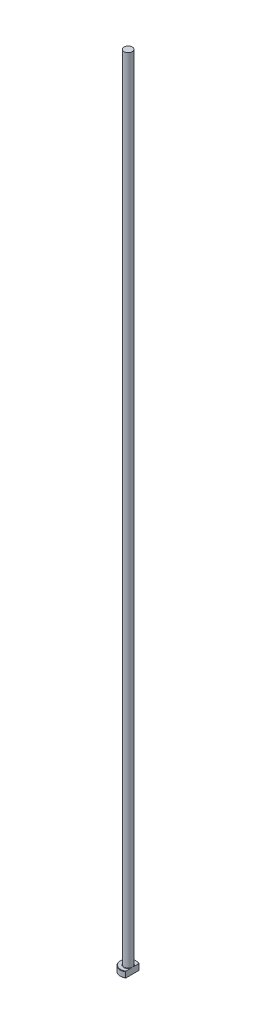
ISO-10303-21;
HEADER;
FILE_DESCRIPTION(('STEP AP214'),'2;1');
FILE_NAME('part.step','',(''),(''),'','','');
FILE_SCHEMA(('AUTOMOTIVE_DESIGN { 1 0 10303 214 1 1 1 1 }'));
ENDSEC;
DATA;
#1=APPLICATION_CONTEXT('core data for automotive mechanical design processes');
#2=APPLICATION_PROTOCOL_DEFINITION('international standard','automotive_design',2000,#1);
#3=PRODUCT_CONTEXT('',#1,'mechanical');
#4=PRODUCT('Part','Part','',(#3));
#5=PRODUCT_RELATED_PRODUCT_CATEGORY('part','',(#4));
#6=PRODUCT_DEFINITION_FORMATION('','',#4);
#7=PRODUCT_DEFINITION_CONTEXT('part definition',#1,'design');
#8=PRODUCT_DEFINITION('design','',#6,#7);
#9=PRODUCT_DEFINITION_SHAPE('','',#8);
#10=(LENGTH_UNIT() NAMED_UNIT(*) SI_UNIT(.MILLI.,.METRE.));
#11=(NAMED_UNIT(*) PLANE_ANGLE_UNIT() SI_UNIT($,.RADIAN.));
#12=(NAMED_UNIT(*) SI_UNIT($,.STERADIAN.) SOLID_ANGLE_UNIT());
#13=UNCERTAINTY_MEASURE_WITH_UNIT(LENGTH_MEASURE(1.E-05),#10,'distance_accuracy_value','');
#14=(GEOMETRIC_REPRESENTATION_CONTEXT(3) GLOBAL_UNCERTAINTY_ASSIGNED_CONTEXT((#13)) GLOBAL_UNIT_ASSIGNED_CONTEXT((#10,
#11,#12)) REPRESENTATION_CONTEXT('',''));
#15=CARTESIAN_POINT('',(0.,0.,0.));
#16=DIRECTION('',(0.,0.,1.));
#17=DIRECTION('',(1.,0.,0.));
#18=AXIS2_PLACEMENT_3D('',#15,#16,#17);
#19=CARTESIAN_POINT('',(0.,0.,0.));
#20=DIRECTION('',(0.,-1.,0.));
#21=DIRECTION('',(0.,0.,-1.));
#22=AXIS2_PLACEMENT_3D('',#19,#20,#21);
#23=PLANE('',#22);
#24=CARTESIAN_POINT('',(0.,0.,0.));
#25=DIRECTION('',(0.,-1.,0.));
#26=DIRECTION('',(0.,0.,-1.));
#27=AXIS2_PLACEMENT_3D('',#24,#25,#26);
#28=CIRCLE('',#27,3.80000000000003);
#29=CARTESIAN_POINT('',(2.04999999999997,0.,3.19960935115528));
#30=VERTEX_POINT('',#29);
#31=CARTESIAN_POINT('',(2.04999999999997,0.,-3.19960935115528));
#32=VERTEX_POINT('',#31);
#33=EDGE_CURVE('E98',#30,#32,#28,.T.);
#34=ORIENTED_EDGE('',*,*,#33,.T.);
#35=DIRECTION('',(0.,0.,1.));
#36=VECTOR('',#35,1.);
#37=CARTESIAN_POINT('',(2.04999999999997,0.,-3.4347488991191));
#38=LINE('',#37,#36);
#39=EDGE_CURVE('E83',#32,#30,#38,.T.);
#40=ORIENTED_EDGE('',*,*,#39,.T.);
#41=EDGE_LOOP('',(#34,#40));
#42=FACE_BOUND('',#41,.T.);
#43=ADVANCED_FACE('F32',(#42),#23,.T.);
#44=CARTESIAN_POINT('',(0.,259.958771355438,0.));
#45=DIRECTION('',(0.,1.,0.));
#46=DIRECTION('',(0.,0.,1.));
#47=AXIS2_PLACEMENT_3D('',#44,#45,#46);
#48=CYLINDRICAL_SURFACE('',#47,3.99999999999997);
#49=CARTESIAN_POINT('',(0.,2.80000000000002,0.));
#50=DIRECTION('',(0.,1.,0.));
#51=DIRECTION('',(0.,0.,1.));
#52=AXIS2_PLACEMENT_3D('',#49,#50,#51);
#53=CIRCLE('',#52,3.99999999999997);
#54=CARTESIAN_POINT('',(2.04999999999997,2.80000000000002,3.4347488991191));
#55=VERTEX_POINT('',#54);
#56=CARTESIAN_POINT('',(2.04999999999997,2.80000000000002,-3.4347488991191));
#57=VERTEX_POINT('',#56);
#58=EDGE_CURVE('E104',#55,#57,#53,.F.);
#59=ORIENTED_EDGE('',*,*,#58,.T.);
#60=DIRECTION('',(0.,-1.,0.));
#61=VECTOR('',#60,1.);
#62=CARTESIAN_POINT('',(2.04999999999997,400.,-3.4347488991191));
#63=LINE('',#62,#61);
#64=CARTESIAN_POINT('',(2.04999999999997,0.199999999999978,-3.4347488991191));
#65=VERTEX_POINT('',#64);
#66=EDGE_CURVE('E183',#57,#65,#63,.T.);
#67=ORIENTED_EDGE('',*,*,#66,.T.);
#68=CARTESIAN_POINT('',(0.,0.199999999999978,0.));
#69=DIRECTION('',(0.,-1.,0.));
#70=DIRECTION('',(0.,0.,-1.));
#71=AXIS2_PLACEMENT_3D('',#68,#69,#70);
#72=CIRCLE('',#71,3.99999999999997);
#73=CARTESIAN_POINT('',(2.04999999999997,0.199999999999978,3.4347488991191));
#74=VERTEX_POINT('',#73);
#75=EDGE_CURVE('E100',#65,#74,#72,.F.);
#76=ORIENTED_EDGE('',*,*,#75,.T.);
#77=DIRECTION('',(0.,-1.,0.));
#78=VECTOR('',#77,1.);
#79=CARTESIAN_POINT('',(2.04999999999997,400.,3.4347488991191));
#80=LINE('',#79,#78);
#81=EDGE_CURVE('E93',#55,#74,#80,.T.);
#82=ORIENTED_EDGE('',*,*,#81,.F.);
#83=EDGE_LOOP('',(#59,#67,#76,#82));
#84=FACE_BOUND('',#83,.T.);
#85=ADVANCED_FACE('F158',(#84),#48,.T.);
#86=CARTESIAN_POINT('',(-3.99999999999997,3.,0.));
#87=DIRECTION('',(0.,1.,0.));
#88=DIRECTION('',(0.,0.,1.));
#89=AXIS2_PLACEMENT_3D('',#86,#87,#88);
#90=PLANE('',#89);
#91=CARTESIAN_POINT('',(0.,3.,0.));
#92=DIRECTION('',(0.,1.,0.));
#93=DIRECTION('',(0.,0.,1.));
#94=AXIS2_PLACEMENT_3D('',#91,#92,#93);
#95=CIRCLE('',#94,3.80000000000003);
#96=CARTESIAN_POINT('',(2.04999999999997,3.,-3.19960935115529));
#97=VERTEX_POINT('',#96);
#98=CARTESIAN_POINT('',(2.04999999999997,3.,3.19960935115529));
#99=VERTEX_POINT('',#98);
#100=EDGE_CURVE('E178',#97,#99,#95,.T.);
#101=ORIENTED_EDGE('',*,*,#100,.T.);
#102=DIRECTION('',(0.,0.,-1.));
#103=VECTOR('',#102,1.);
#104=CARTESIAN_POINT('',(2.04999999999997,3.,0.));
#105=LINE('',#104,#103);
#106=CARTESIAN_POINT('',(2.04999999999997,2.99999999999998,0.927361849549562));
#107=VERTEX_POINT('',#106);
#108=EDGE_CURVE('E57',#99,#107,#105,.T.);
#109=ORIENTED_EDGE('',*,*,#108,.T.);
#110=CARTESIAN_POINT('',(0.,3.,0.));
#111=DIRECTION('',(0.,1.,0.));
#112=DIRECTION('',(0.,0.,1.));
#113=AXIS2_PLACEMENT_3D('',#110,#111,#112);
#114=CIRCLE('',#113,2.24999999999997);
#115=CARTESIAN_POINT('',(2.04999999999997,2.99999999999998,-0.927361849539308));
#116=VERTEX_POINT('',#115);
#117=EDGE_CURVE('E107',#107,#116,#114,.F.);
#118=ORIENTED_EDGE('',*,*,#117,.T.);
#119=EDGE_CURVE('E136',#116,#97,#105,.T.);
#120=ORIENTED_EDGE('',*,*,#119,.T.);
#121=EDGE_LOOP('',(#101,#109,#118,#120));
#122=FACE_BOUND('',#121,.T.);
#123=ADVANCED_FACE('F147',(#122),#90,.T.);
#124=CARTESIAN_POINT('',(0.,3.,0.));
#125=DIRECTION('',(0.,-1.,0.));
#126=DIRECTION('',(0.,0.,-1.));
#127=AXIS2_PLACEMENT_3D('',#124,#125,#126);
#128=CONICAL_SURFACE('',#127,3.80000000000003,0.785398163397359);
#129=ORIENTED_EDGE('',*,*,#58,.F.);
#130=CARTESIAN_POINT('',(2.04999999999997,-1.03146351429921,7.55839406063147));
#131=CARTESIAN_POINT('',(2.04999999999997,-0.873904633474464,7.39513453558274));
#132=CARTESIAN_POINT('',(2.04999999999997,-0.716518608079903,7.23170767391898));
#133=CARTESIAN_POINT('',(2.04999999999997,-0.402187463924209,6.90442717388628));
#134=CARTESIAN_POINT('',(2.04999999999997,-0.245242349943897,6.74057353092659));
#135=CARTESIAN_POINT('',(2.04999999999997,0.0681734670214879,6.41228269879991));
#136=CARTESIAN_POINT('',(2.04999999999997,0.224643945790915,6.2478452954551));
#137=CARTESIAN_POINT('',(2.04999999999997,0.536906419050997,5.91832867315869));
#138=CARTESIAN_POINT('',(2.04999999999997,0.692698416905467,5.75324945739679));
#139=CARTESIAN_POINT('',(2.04999999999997,1.00064251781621,5.42523572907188));
#140=CARTESIAN_POINT('',(2.04999999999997,1.15280992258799,5.26231559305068));
#141=CARTESIAN_POINT('',(2.04999999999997,1.4560630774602,4.93547204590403));
#142=CARTESIAN_POINT('',(2.04999999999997,1.60714883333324,4.77154864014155));
#143=CARTESIAN_POINT('',(2.04999999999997,1.9078557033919,4.44241540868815));
#144=CARTESIAN_POINT('',(2.04999999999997,2.0574770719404,4.27720581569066));
#145=CARTESIAN_POINT('',(2.04999999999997,2.35475209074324,3.94502824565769));
#146=CARTESIAN_POINT('',(2.04999999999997,2.50240579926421,3.77806032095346));
#147=CARTESIAN_POINT('',(2.04999999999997,2.74781587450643,3.49583336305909));
#148=CARTESIAN_POINT('',(2.04999999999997,2.84633082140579,3.38123477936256));
#149=CARTESIAN_POINT('',(2.04999999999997,3.04168132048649,3.15059166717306));
#150=CARTESIAN_POINT('',(2.04999999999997,3.13851670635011,3.0345469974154));
#151=CARTESIAN_POINT('',(2.04999999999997,3.33089134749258,2.79943466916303));
#152=CARTESIAN_POINT('',(2.04999999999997,3.42640790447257,2.68034837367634));
#153=CARTESIAN_POINT('',(2.04999999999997,3.61424509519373,2.43971344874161));
#154=CARTESIAN_POINT('',(2.04999999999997,3.70656652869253,2.31816544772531));
#155=CARTESIAN_POINT('',(2.04999999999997,3.88795970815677,2.06996820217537));
#156=CARTESIAN_POINT('',(2.04999999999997,3.97696605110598,1.94327085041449));
#157=CARTESIAN_POINT('',(2.04999999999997,4.14815278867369,1.68499648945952));
#158=CARTESIAN_POINT('',(2.04999999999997,4.23032373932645,1.55341308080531));
#159=CARTESIAN_POINT('',(2.04999999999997,4.34487781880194,1.3520675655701));
#160=CARTESIAN_POINT('',(2.04999999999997,4.38142455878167,1.28469323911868));
#161=CARTESIAN_POINT('',(2.04999999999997,4.45108462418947,1.14819983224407));
#162=CARTESIAN_POINT('',(2.04999999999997,4.48419730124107,1.07908042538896));
#163=CARTESIAN_POINT('',(2.04999999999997,4.57688716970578,0.869158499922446));
#164=CARTESIAN_POINT('',(2.04999999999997,4.6301133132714,0.725295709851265));
#165=CARTESIAN_POINT('',(2.04999999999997,4.6885814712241,0.50978217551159));
#166=CARTESIAN_POINT('',(2.04999999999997,4.70423178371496,0.440932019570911));
#167=CARTESIAN_POINT('',(2.04999999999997,4.72899377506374,0.30204122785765));
#168=CARTESIAN_POINT('',(2.04999999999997,4.73810615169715,0.232000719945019));
#169=CARTESIAN_POINT('',(2.04999999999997,4.74914212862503,0.0916144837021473));
#170=CARTESIAN_POINT('',(2.04999999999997,4.75109292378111,0.021270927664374));
#171=CARTESIAN_POINT('',(2.04999999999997,4.74773665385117,-0.119244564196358));
#172=CARTESIAN_POINT('',(2.04999999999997,4.74242910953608,-0.189416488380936));
#173=CARTESIAN_POINT('',(2.04999999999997,4.72500657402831,-0.328355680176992));
#174=CARTESIAN_POINT('',(2.04999999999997,4.71294307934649,-0.397129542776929));
#175=CARTESIAN_POINT('',(2.04999999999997,4.68280191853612,-0.533332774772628));
#176=CARTESIAN_POINT('',(2.04999999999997,4.66472343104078,-0.600761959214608));
#177=CARTESIAN_POINT('',(2.04999999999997,4.62334379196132,-0.734440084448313));
#178=CARTESIAN_POINT('',(2.04999999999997,4.60001057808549,-0.800678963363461));
#179=CARTESIAN_POINT('',(2.04999999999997,4.54910792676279,-0.931471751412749));
#180=CARTESIAN_POINT('',(2.04999999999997,4.52153930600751,-0.996025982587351));
#181=CARTESIAN_POINT('',(2.04999999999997,4.43580994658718,-1.18273856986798));
#182=CARTESIAN_POINT('',(2.04999999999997,4.3730026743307,-1.30275656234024));
#183=CARTESIAN_POINT('',(2.04999999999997,4.23899016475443,-1.53805589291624));
#184=CARTESIAN_POINT('',(2.04999999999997,4.16777470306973,-1.6533312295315));
#185=CARTESIAN_POINT('',(2.04999999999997,4.01940383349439,-1.88059522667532));
#186=CARTESIAN_POINT('',(2.04999999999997,3.94222660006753,-1.99256951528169));
#187=CARTESIAN_POINT('',(2.04999999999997,3.78394545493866,-2.21359913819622));
#188=CARTESIAN_POINT('',(2.04999999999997,3.7028434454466,-2.32265584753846));
#189=CARTESIAN_POINT('',(2.04999999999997,3.5367260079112,-2.53996457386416));
#190=CARTESIAN_POINT('',(2.04999999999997,3.45167369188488,-2.64818825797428));
#191=CARTESIAN_POINT('',(2.04999999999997,3.27939927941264,-2.86290587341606));
#192=CARTESIAN_POINT('',(2.04999999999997,3.19217696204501,-2.96939962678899));
#193=CARTESIAN_POINT('',(2.04999999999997,3.01630213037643,-3.18076958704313));
#194=CARTESIAN_POINT('',(2.04999999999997,2.92765349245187,-3.28564902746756));
#195=CARTESIAN_POINT('',(2.04999999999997,2.74908778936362,-3.49432359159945));
#196=CARTESIAN_POINT('',(2.04999999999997,2.65917070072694,-3.59811869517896));
#197=CARTESIAN_POINT('',(2.04999999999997,2.42106477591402,-3.87030922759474));
#198=CARTESIAN_POINT('',(2.04999999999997,2.27204417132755,-4.03797649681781));
#199=CARTESIAN_POINT('',(2.04999999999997,1.97212991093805,-4.37162983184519));
#200=CARTESIAN_POINT('',(2.04999999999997,1.82123620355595,-4.53761585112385));
#201=CARTESIAN_POINT('',(2.04999999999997,1.51793530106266,-4.8684779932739));
#202=CARTESIAN_POINT('',(2.04999999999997,1.36552684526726,-5.03335295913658));
#203=CARTESIAN_POINT('',(2.04999999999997,1.059671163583,-5.36213642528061));
#204=CARTESIAN_POINT('',(2.04999999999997,0.906223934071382,-5.52604492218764));
#205=CARTESIAN_POINT('',(2.04999999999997,0.604770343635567,-5.84646863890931));
#206=CARTESIAN_POINT('',(2.04999999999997,0.456795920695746,-6.00301392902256));
#207=CARTESIAN_POINT('',(2.04999999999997,0.160257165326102,-6.31554566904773));
#208=CARTESIAN_POINT('',(2.04999999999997,0.0116928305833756,-6.47153211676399));
#209=CARTESIAN_POINT('',(2.04999999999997,-0.285748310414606,-6.78287905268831));
#210=CARTESIAN_POINT('',(2.04999999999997,-0.434624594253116,-6.93824004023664));
#211=CARTESIAN_POINT('',(2.04999999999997,-0.73276964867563,-7.24858246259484));
#212=CARTESIAN_POINT('',(2.04999999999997,-0.882038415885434,-7.40356390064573));
#213=CARTESIAN_POINT('',(2.04999999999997,-1.03146351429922,-7.55839406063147));
#214=B_SPLINE_CURVE_WITH_KNOTS('',3,(#130,#131,#132,#133,#134,#135,#136,#137,#138,#139,#140,
#141,#142,#143,#144,#145,#146,#147,#148,#149,#150,#151,#152,#153,#154,#155,#156,#157,#158,#159,
#160,#161,#162,#163,#164,#165,#166,#167,#168,#169,#170,#171,#172,#173,#174,#175,#176,#177,#178,
#179,#180,#181,#182,#183,#184,#185,#186,#187,#188,#189,#190,#191,#192,#193,#194,#195,#196,#197,
#198,#199,#200,#201,#202,#203,#204,#205,#206,#207,#208,#209,#210,#211,#212,#213),.UNSPECIFIED.,
.F.,.F.,(4,2,2,2,2,2,2,2,2,2,2,2,2,2,2,2,2,2,2,2,2,2,2,2,2,2,2,2,2,2,2,2,2,2,2,2,2,2,2,2,2,4),
(0.,0.680666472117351,1.36134029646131,2.04229694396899,2.72325021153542,3.39203729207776,
4.06082080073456,4.72948600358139,5.3981313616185,5.85148716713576,6.30488761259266,
6.76282955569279,7.22065603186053,7.68503359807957,8.1500424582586,8.37989203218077,
8.60978492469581,9.06784199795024,9.27940643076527,9.49094828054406,9.70168600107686,
9.91243763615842,10.1216042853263,10.33079950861,10.5413075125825,10.751774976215,
11.1575695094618,11.5638626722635,11.9717209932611,12.3793835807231,12.7922829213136,
13.2052244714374,13.6171880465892,14.0291592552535,14.7020968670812,15.3750530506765,
16.0486261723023,16.722201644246,17.3684394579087,18.0146798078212,18.6602103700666,
19.3057354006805),.UNSPECIFIED.);
#215=EDGE_CURVE('E135',#55,#99,#214,.T.);
#216=ORIENTED_EDGE('',*,*,#215,.T.);
#217=ORIENTED_EDGE('',*,*,#100,.F.);
#218=EDGE_CURVE('E127',#97,#57,#214,.T.);
#219=ORIENTED_EDGE('',*,*,#218,.T.);
#220=EDGE_LOOP('',(#129,#216,#217,#219));
#221=FACE_BOUND('',#220,.T.);
#222=ADVANCED_FACE('F143',(#221),#128,.T.);
#223=CARTESIAN_POINT('',(0.,0.199999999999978,0.));
#224=DIRECTION('',(0.,1.,0.));
#225=DIRECTION('',(0.,0.,1.));
#226=AXIS2_PLACEMENT_3D('',#223,#224,#225);
#227=CONICAL_SURFACE('',#226,3.99999999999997,0.785398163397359);
#228=ORIENTED_EDGE('',*,*,#75,.F.);
#229=CARTESIAN_POINT('',(2.04999999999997,4.03146351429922,-7.55839406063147));
#230=CARTESIAN_POINT('',(2.04999999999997,3.87390463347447,-7.39513453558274));
#231=CARTESIAN_POINT('',(2.04999999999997,3.7165186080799,-7.23170767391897));
#232=CARTESIAN_POINT('',(2.04999999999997,3.40218746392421,-6.90442717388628));
#233=CARTESIAN_POINT('',(2.04999999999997,3.2452423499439,-6.74057353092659));
#234=CARTESIAN_POINT('',(2.04999999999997,2.93182653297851,-6.41228269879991));
#235=CARTESIAN_POINT('',(2.04999999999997,2.77535605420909,-6.2478452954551));
#236=CARTESIAN_POINT('',(2.04999999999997,2.463093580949,-5.91832867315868));
#237=CARTESIAN_POINT('',(2.04999999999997,2.30730158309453,-5.75324945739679));
#238=CARTESIAN_POINT('',(2.04999999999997,1.99935748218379,-5.42523572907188));
#239=CARTESIAN_POINT('',(2.04999999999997,1.84719007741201,-5.26231559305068));
#240=CARTESIAN_POINT('',(2.04999999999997,1.5439369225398,-4.93547204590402));
#241=CARTESIAN_POINT('',(2.04999999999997,1.39285116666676,-4.77154864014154));
#242=CARTESIAN_POINT('',(2.04999999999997,1.0921442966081,-4.44241540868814));
#243=CARTESIAN_POINT('',(2.04999999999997,0.942522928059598,-4.27720581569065));
#244=CARTESIAN_POINT('',(2.04999999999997,0.645247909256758,-3.94502824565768));
#245=CARTESIAN_POINT('',(2.04999999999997,0.497594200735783,-3.77806032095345));
#246=CARTESIAN_POINT('',(2.04999999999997,0.25218412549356,-3.49583336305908));
#247=CARTESIAN_POINT('',(2.04999999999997,0.153669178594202,-3.38123477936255));
#248=CARTESIAN_POINT('',(2.04999999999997,-0.0416813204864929,-3.15059166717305));
#249=CARTESIAN_POINT('',(2.04999999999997,-0.138516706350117,-3.03454699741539));
#250=CARTESIAN_POINT('',(2.04999999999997,-0.330891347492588,-2.79943466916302));
#251=CARTESIAN_POINT('',(2.04999999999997,-0.426407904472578,-2.68034837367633));
#252=CARTESIAN_POINT('',(2.04999999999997,-0.614245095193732,-2.43971344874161));
#253=CARTESIAN_POINT('',(2.04999999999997,-0.70656652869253,-2.3181654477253));
#254=CARTESIAN_POINT('',(2.04999999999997,-0.887959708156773,-2.06996820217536));
#255=CARTESIAN_POINT('',(2.04999999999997,-0.976966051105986,-1.94327085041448));
#256=CARTESIAN_POINT('',(2.04999999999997,-1.14815278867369,-1.68499648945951));
#257=CARTESIAN_POINT('',(2.04999999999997,-1.23032373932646,-1.5534130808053));
#258=CARTESIAN_POINT('',(2.04999999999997,-1.34487781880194,-1.35206756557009));
#259=CARTESIAN_POINT('',(2.04999999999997,-1.38142455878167,-1.28469323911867));
#260=CARTESIAN_POINT('',(2.04999999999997,-1.45108462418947,-1.14819983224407));
#261=CARTESIAN_POINT('',(2.04999999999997,-1.48419730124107,-1.07908042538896));
#262=CARTESIAN_POINT('',(2.04999999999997,-1.57688716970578,-0.86915849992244));
#263=CARTESIAN_POINT('',(2.04999999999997,-1.63011331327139,-0.72529570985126));
#264=CARTESIAN_POINT('',(2.04999999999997,-1.6885814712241,-0.509782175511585));
#265=CARTESIAN_POINT('',(2.04999999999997,-1.70423178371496,-0.440932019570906));
#266=CARTESIAN_POINT('',(2.04999999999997,-1.72899377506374,-0.302041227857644));
#267=CARTESIAN_POINT('',(2.04999999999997,-1.73810615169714,-0.232000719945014));
#268=CARTESIAN_POINT('',(2.04999999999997,-1.74914212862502,-0.0916144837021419));
#269=CARTESIAN_POINT('',(2.04999999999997,-1.75109292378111,-0.0212709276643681));
#270=CARTESIAN_POINT('',(2.04999999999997,-1.74773665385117,0.119244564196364));
#271=CARTESIAN_POINT('',(2.04999999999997,-1.74242910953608,0.189416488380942));
#272=CARTESIAN_POINT('',(2.04999999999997,-1.72500657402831,0.328355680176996));
#273=CARTESIAN_POINT('',(2.04999999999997,-1.71294307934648,0.397129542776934));
#274=CARTESIAN_POINT('',(2.04999999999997,-1.68280191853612,0.533332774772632));
#275=CARTESIAN_POINT('',(2.04999999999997,-1.66472343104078,0.600761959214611));
#276=CARTESIAN_POINT('',(2.04999999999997,-1.62334379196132,0.734440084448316));
#277=CARTESIAN_POINT('',(2.04999999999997,-1.60001057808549,0.800678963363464));
#278=CARTESIAN_POINT('',(2.04999999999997,-1.54910792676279,0.931471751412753));
#279=CARTESIAN_POINT('',(2.04999999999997,-1.5215393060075,0.996025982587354));
#280=CARTESIAN_POINT('',(2.04999999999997,-1.43580994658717,1.18273856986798));
#281=CARTESIAN_POINT('',(2.04999999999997,-1.37300267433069,1.30275656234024));
#282=CARTESIAN_POINT('',(2.04999999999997,-1.23899016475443,1.53805589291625));
#283=CARTESIAN_POINT('',(2.04999999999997,-1.16777470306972,1.65333122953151));
#284=CARTESIAN_POINT('',(2.04999999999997,-1.01940383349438,1.88059522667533));
#285=CARTESIAN_POINT('',(2.04999999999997,-0.942226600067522,1.9925695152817));
#286=CARTESIAN_POINT('',(2.04999999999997,-0.783945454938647,2.21359913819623));
#287=CARTESIAN_POINT('',(2.04999999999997,-0.702843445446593,2.32265584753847));
#288=CARTESIAN_POINT('',(2.04999999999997,-0.536726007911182,2.53996457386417));
#289=CARTESIAN_POINT('',(2.04999999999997,-0.451673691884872,2.6481882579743));
#290=CARTESIAN_POINT('',(2.04999999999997,-0.279399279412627,2.86290587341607));
#291=CARTESIAN_POINT('',(2.04999999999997,-0.192176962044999,2.96939962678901));
#292=CARTESIAN_POINT('',(2.04999999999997,-0.0163021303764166,3.18076958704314));
#293=CARTESIAN_POINT('',(2.04999999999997,0.0723465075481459,3.28564902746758));
#294=CARTESIAN_POINT('',(2.04999999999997,0.250912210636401,3.49432359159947));
#295=CARTESIAN_POINT('',(2.04999999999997,0.340829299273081,3.59811869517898));
#296=CARTESIAN_POINT('',(2.04999999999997,0.578935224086,3.87030922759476));
#297=CARTESIAN_POINT('',(2.04999999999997,0.727955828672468,4.03797649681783));
#298=CARTESIAN_POINT('',(2.04999999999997,1.02787008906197,4.3716298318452));
#299=CARTESIAN_POINT('',(2.04999999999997,1.17876379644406,4.53761585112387));
#300=CARTESIAN_POINT('',(2.04999999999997,1.48206469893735,4.86847799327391));
#301=CARTESIAN_POINT('',(2.04999999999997,1.63447315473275,5.03335295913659));
#302=CARTESIAN_POINT('',(2.04999999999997,1.94032883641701,5.36213642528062));
#303=CARTESIAN_POINT('',(2.04999999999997,2.09377606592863,5.52604492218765));
#304=CARTESIAN_POINT('',(2.04999999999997,2.39522965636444,5.84646863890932));
#305=CARTESIAN_POINT('',(2.04999999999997,2.54320407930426,6.00301392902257));
#306=CARTESIAN_POINT('',(2.04999999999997,2.83974283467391,6.31554566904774));
#307=CARTESIAN_POINT('',(2.04999999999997,2.98830716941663,6.47153211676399));
#308=CARTESIAN_POINT('',(2.04999999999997,3.28574831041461,6.78287905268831));
#309=CARTESIAN_POINT('',(2.04999999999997,3.43462459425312,6.93824004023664));
#310=CARTESIAN_POINT('',(2.04999999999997,3.73276964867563,7.24858246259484));
#311=CARTESIAN_POINT('',(2.04999999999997,3.88203841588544,7.40356390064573));
#312=CARTESIAN_POINT('',(2.04999999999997,4.03146351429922,7.55839406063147));
#313=B_SPLINE_CURVE_WITH_KNOTS('',3,(#229,#230,#231,#232,#233,#234,#235,#236,#237,#238,#239,
#240,#241,#242,#243,#244,#245,#246,#247,#248,#249,#250,#251,#252,#253,#254,#255,#256,#257,#258,
#259,#260,#261,#262,#263,#264,#265,#266,#267,#268,#269,#270,#271,#272,#273,#274,#275,#276,#277,
#278,#279,#280,#281,#282,#283,#284,#285,#286,#287,#288,#289,#290,#291,#292,#293,#294,#295,#296,
#297,#298,#299,#300,#301,#302,#303,#304,#305,#306,#307,#308,#309,#310,#311,#312),.UNSPECIFIED.,
.F.,.F.,(4,2,2,2,2,2,2,2,2,2,2,2,2,2,2,2,2,2,2,2,2,2,2,2,2,2,2,2,2,2,2,2,2,2,2,2,2,2,2,2,2,4),
(0.,0.680666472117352,1.36134029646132,2.042296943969,2.72325021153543,3.39203729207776,
4.06082080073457,4.72948600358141,5.39813136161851,5.85148716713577,6.30488761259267,
6.7628295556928,7.22065603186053,7.68503359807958,8.15004245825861,8.37989203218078,
8.60978492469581,9.06784199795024,9.27940643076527,9.49094828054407,9.70168600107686,
9.91243763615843,10.1216042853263,10.33079950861,10.5413075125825,10.751774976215,
11.1575695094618,11.5638626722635,11.9717209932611,12.3793835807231,12.7922829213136,
13.2052244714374,13.6171880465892,14.0291592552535,14.7020968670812,15.3750530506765,
16.0486261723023,16.722201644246,17.3684394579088,18.0146798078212,18.6602103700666,
19.3057354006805),.UNSPECIFIED.);
#314=EDGE_CURVE('E86',#65,#32,#313,.T.);
#315=ORIENTED_EDGE('',*,*,#314,.T.);
#316=ORIENTED_EDGE('',*,*,#33,.F.);
#317=EDGE_CURVE('E89',#30,#74,#313,.T.);
#318=ORIENTED_EDGE('',*,*,#317,.T.);
#319=EDGE_LOOP('',(#228,#315,#316,#318));
#320=FACE_BOUND('',#319,.T.);
#321=ADVANCED_FACE('F97',(#320),#227,.T.);
#322=CARTESIAN_POINT('',(0.,3.19999999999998,0.));
#323=DIRECTION('',(0.,1.,0.));
#324=DIRECTION('',(0.,0.,1.));
#325=AXIS2_PLACEMENT_3D('',#322,#323,#324);
#326=TOROIDAL_SURFACE('',#325,2.24999999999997,0.2);
#327=CARTESIAN_POINT('',(2.04999999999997,3.19999999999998,0.));
#328=CARTESIAN_POINT('',(2.04999999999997,3.20000050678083,1.11433978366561E-10));
#329=CARTESIAN_POINT('',(2.04999999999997,3.20000101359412,-1.49199173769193E-07));
#330=CARTESIAN_POINT('',(2.04999999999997,3.20000197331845,-5.90092849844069E-07));
#331=CARTESIAN_POINT('',(2.04999999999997,3.20000242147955,-8.89334890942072E-07));
#332=CARTESIAN_POINT('',(2.04999999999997,3.200003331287,-1.60386249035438E-06));
#333=CARTESIAN_POINT('',(2.04999999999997,3.20000378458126,-2.02988262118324E-06));
#334=CARTESIAN_POINT('',(2.04999999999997,3.20000461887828,-2.92958555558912E-06));
#335=CARTESIAN_POINT('',(2.04999999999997,3.20000500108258,-3.40221864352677E-06));
#336=CARTESIAN_POINT('',(2.04999999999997,3.20000635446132,-5.1677876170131E-06));
#337=CARTESIAN_POINT('',(2.04999999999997,3.20000725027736,-6.52020726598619E-06));
#338=CARTESIAN_POINT('',(2.04999999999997,3.20000878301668,-9.25136186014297E-06));
#339=CARTESIAN_POINT('',(2.04999999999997,3.20000943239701,-1.06234618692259E-05));
#340=CARTESIAN_POINT('',(2.04999999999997,3.20001203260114,-1.6232674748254E-05));
#341=CARTESIAN_POINT('',(2.04999999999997,3.20001389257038,-2.05163580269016E-05));
#342=CARTESIAN_POINT('',(2.04999999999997,3.20001674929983,-2.87532844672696E-05));
#343=CARTESIAN_POINT('',(2.04999999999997,3.20001782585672,-3.2679073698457E-05));
#344=CARTESIAN_POINT('',(2.04999999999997,3.20002546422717,-6.12436551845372E-05));
#345=CARTESIAN_POINT('',(2.04999999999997,3.20003105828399,-8.60941961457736E-05));
#346=CARTESIAN_POINT('',(2.04999999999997,3.20005552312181,-0.000183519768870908));
#347=CARTESIAN_POINT('',(2.04999999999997,3.20007904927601,-0.000254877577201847));
#348=CARTESIAN_POINT('',(2.04999999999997,3.20016988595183,-0.000535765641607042));
#349=CARTESIAN_POINT('',(2.04999999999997,3.20023402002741,-0.000746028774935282));
#350=CARTESIAN_POINT('',(2.04999999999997,3.20048927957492,-0.0015758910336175));
#351=CARTESIAN_POINT('',(2.04999999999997,3.20068429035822,-0.00219457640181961));
#352=CARTESIAN_POINT('',(2.04999999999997,3.20148922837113,-0.00475596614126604));
#353=CARTESIAN_POINT('',(2.04999999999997,3.20209434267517,-0.0066998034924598));
#354=CARTESIAN_POINT('',(2.04999999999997,3.20817248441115,-0.026215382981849));
#355=CARTESIAN_POINT('',(2.04999999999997,3.21366777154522,-0.0437820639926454));
#356=CARTESIAN_POINT('',(2.04999999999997,3.22440004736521,-0.0782469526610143));
#357=CARTESIAN_POINT('',(2.04999999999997,3.22963878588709,-0.0951446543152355));
#358=CARTESIAN_POINT('',(2.04999999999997,3.24070596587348,-0.13103721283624));
#359=CARTESIAN_POINT('',(2.04999999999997,3.24652762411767,-0.150034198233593));
#360=CARTESIAN_POINT('',(2.04999999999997,3.25812563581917,-0.188263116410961));
#361=CARTESIAN_POINT('',(2.04999999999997,3.26390084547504,-0.207495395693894));
#362=CARTESIAN_POINT('',(2.04999999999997,3.27784177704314,-0.254568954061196));
#363=CARTESIAN_POINT('',(2.04999999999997,3.28592802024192,-0.282433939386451));
#364=CARTESIAN_POINT('',(2.04999999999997,3.30147824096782,-0.337598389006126));
#365=CARTESIAN_POINT('',(2.04999999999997,3.30895263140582,-0.364894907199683));
#366=CARTESIAN_POINT('',(2.04999999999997,3.32487272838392,-0.425333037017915));
#367=CARTESIAN_POINT('',(2.04999999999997,3.33319621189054,-0.458507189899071));
#368=CARTESIAN_POINT('',(2.04999999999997,3.34887938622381,-0.525344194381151));
#369=CARTESIAN_POINT('',(2.04999999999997,3.35623148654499,-0.559008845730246));
#370=CARTESIAN_POINT('',(2.04999999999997,3.3700913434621,-0.629073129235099));
#371=CARTESIAN_POINT('',(2.04999999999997,3.37649834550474,-0.665493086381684));
#372=CARTESIAN_POINT('',(2.04999999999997,3.38732437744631,-0.738624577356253));
#373=CARTESIAN_POINT('',(2.04999999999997,3.39174404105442,-0.775336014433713));
#374=CARTESIAN_POINT('',(2.04999999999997,3.39842323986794,-0.853869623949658));
#375=CARTESIAN_POINT('',(2.04999999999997,3.40031921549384,-0.895724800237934));
#376=CARTESIAN_POINT('',(2.04999999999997,3.3995967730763,-0.978802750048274));
#377=CARTESIAN_POINT('',(2.04999999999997,3.39705088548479,-1.02002480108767));
#378=CARTESIAN_POINT('',(2.04999999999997,3.38815866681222,-1.08355885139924));
#379=CARTESIAN_POINT('',(2.04999999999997,3.38399133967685,-1.10617047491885));
#380=CARTESIAN_POINT('',(2.04999999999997,3.37312056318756,-1.1508734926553));
#381=CARTESIAN_POINT('',(2.04999999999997,3.36641150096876,-1.17296361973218));
#382=CARTESIAN_POINT('',(2.04999999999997,3.35241630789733,-1.20879754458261));
#383=CARTESIAN_POINT('',(2.04999999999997,3.34604663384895,-1.22289572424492));
#384=CARTESIAN_POINT('',(2.04999999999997,3.33145856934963,-1.25010305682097));
#385=CARTESIAN_POINT('',(2.04999999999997,3.32324484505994,-1.26321459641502));
#386=CARTESIAN_POINT('',(2.04999999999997,3.30807074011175,-1.28311183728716));
#387=CARTESIAN_POINT('',(2.04999999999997,3.30180162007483,-1.29042146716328));
#388=CARTESIAN_POINT('',(2.04999999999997,3.28827985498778,-1.30407693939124));
#389=CARTESIAN_POINT('',(2.04999999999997,3.28102850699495,-1.31042402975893));
#390=CARTESIAN_POINT('',(2.04999999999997,3.26730073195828,-1.32042781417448));
#391=CARTESIAN_POINT('',(2.04999999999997,3.26103227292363,-1.32436729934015));
#392=CARTESIAN_POINT('',(2.04999999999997,3.24793774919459,-1.33118589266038));
#393=CARTESIAN_POINT('',(2.04999999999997,3.2411121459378,-1.3340658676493));
#394=CARTESIAN_POINT('',(2.04999999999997,3.22696550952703,-1.33854399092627));
#395=CARTESIAN_POINT('',(2.04999999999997,3.21964010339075,-1.34012865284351));
#396=CARTESIAN_POINT('',(2.04999999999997,3.20482104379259,-1.34178557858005));
#397=CARTESIAN_POINT('',(2.04999999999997,3.19732755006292,-1.34185922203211));
#398=CARTESIAN_POINT('',(2.04999999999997,3.18362821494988,-1.34059674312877));
#399=CARTESIAN_POINT('',(2.04999999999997,3.17740126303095,-1.3394752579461));
#400=CARTESIAN_POINT('',(2.04999999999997,3.16521180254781,-1.33624238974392));
#401=CARTESIAN_POINT('',(2.04999999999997,3.15924940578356,-1.33413059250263));
#402=CARTESIAN_POINT('',(2.04999999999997,3.14588128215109,-1.32826056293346));
#403=CARTESIAN_POINT('',(2.04999999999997,3.13861186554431,-1.324193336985));
#404=CARTESIAN_POINT('',(2.04999999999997,3.1248230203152,-1.314942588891));
#405=CARTESIAN_POINT('',(2.04999999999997,3.11830521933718,-1.30975671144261));
#406=CARTESIAN_POINT('',(2.04999999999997,3.10285879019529,-1.29569016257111));
#407=CARTESIAN_POINT('',(2.04999999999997,3.09441467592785,-1.28628110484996));
#408=CARTESIAN_POINT('',(2.04999999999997,3.07905572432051,-1.26631405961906));
#409=CARTESIAN_POINT('',(2.04999999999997,3.07214294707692,-1.25575455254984));
#410=CARTESIAN_POINT('',(2.04999999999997,3.05475343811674,-1.22547453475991));
#411=CARTESIAN_POINT('',(2.04999999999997,3.04564540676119,-1.20497519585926));
#412=CARTESIAN_POINT('',(2.04999999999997,3.03036658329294,-1.16279344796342));
#413=CARTESIAN_POINT('',(2.04999999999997,3.02422151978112,-1.14110243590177));
#414=CARTESIAN_POINT('',(2.04999999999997,3.01411308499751,-1.09654657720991));
#415=CARTESIAN_POINT('',(2.04999999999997,3.01022074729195,-1.07366604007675));
#416=CARTESIAN_POINT('',(2.04999999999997,3.00438595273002,-1.02762855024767));
#417=CARTESIAN_POINT('',(2.04999999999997,3.00244735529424,-1.00447114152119));
#418=CARTESIAN_POINT('',(2.04999999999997,2.99907945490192,-0.936481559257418));
#419=CARTESIAN_POINT('',(2.04999999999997,2.99980550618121,-0.891546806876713));
#420=CARTESIAN_POINT('',(2.04999999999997,3.00639312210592,-0.785106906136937));
#421=CARTESIAN_POINT('',(2.04999999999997,3.01408723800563,-0.723739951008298));
#422=CARTESIAN_POINT('',(2.04999999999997,3.03471721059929,-0.600423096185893));
#423=CARTESIAN_POINT('',(2.04999999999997,3.04777621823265,-0.538495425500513));
#424=CARTESIAN_POINT('',(2.04999999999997,3.07250330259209,-0.435218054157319));
#425=CARTESIAN_POINT('',(2.04999999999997,3.08327201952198,-0.393644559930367));
#426=CARTESIAN_POINT('',(2.04999999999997,3.1057691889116,-0.311244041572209));
#427=CARTESIAN_POINT('',(2.04999999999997,3.117485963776,-0.270413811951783));
#428=CARTESIAN_POINT('',(2.04999999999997,3.14023315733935,-0.193479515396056));
#429=CARTESIAN_POINT('',(2.04999999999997,3.15119500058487,-0.157354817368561));
#430=CARTESIAN_POINT('',(2.04999999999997,3.17387809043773,-0.083701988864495));
#431=CARTESIAN_POINT('',(2.04999999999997,3.18561198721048,-0.0461776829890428));
#432=CARTESIAN_POINT('',(2.04999999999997,3.19790660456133,-0.00669647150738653));
#433=CARTESIAN_POINT('',(2.04999999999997,3.19851281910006,-0.00474933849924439));
#434=CARTESIAN_POINT('',(2.04999999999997,3.19931801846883,-0.00218718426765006));
#435=CARTESIAN_POINT('',(2.04999999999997,3.19951222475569,-0.00157103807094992));
#436=CARTESIAN_POINT('',(2.04999999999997,3.1997665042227,-0.000744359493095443));
#437=CARTESIAN_POINT('',(2.04999999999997,3.1998304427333,-0.000534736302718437));
#438=CARTESIAN_POINT('',(2.04999999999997,3.19992104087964,-0.000254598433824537));
#439=CARTESIAN_POINT('',(2.04999999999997,3.19994453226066,-0.000183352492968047));
#440=CARTESIAN_POINT('',(2.04999999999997,3.19996896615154,-8.60574042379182E-05));
#441=CARTESIAN_POINT('',(2.04999999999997,3.19997455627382,-6.12234779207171E-05));
#442=CARTESIAN_POINT('',(2.04999999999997,3.19998218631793,-3.26756404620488E-05));
#443=CARTESIAN_POINT('',(2.04999999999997,3.19998326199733,-2.87508616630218E-05));
#444=CARTESIAN_POINT('',(2.04999999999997,3.19998611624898,-2.05159271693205E-05));
#445=CARTESIAN_POINT('',(2.04999999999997,3.19998797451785,-1.62331737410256E-05));
#446=CARTESIAN_POINT('',(2.04999999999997,3.19999057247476,-1.06248953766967E-05));
#447=CARTESIAN_POINT('',(2.04999999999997,3.19999122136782,-9.25287084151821E-06));
#448=CARTESIAN_POINT('',(2.04999999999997,3.19999275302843,-6.52177957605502E-06));
#449=CARTESIAN_POINT('',(2.04999999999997,3.19999364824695,-5.16933999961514E-06));
#450=CARTESIAN_POINT('',(2.04999999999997,3.19999500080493,-3.40363971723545E-06));
#451=CARTESIAN_POINT('',(2.04999999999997,3.19999538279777,-2.93094612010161E-06));
#452=CARTESIAN_POINT('',(2.04999999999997,3.19999621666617,-2.03108406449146E-06));
#453=CARTESIAN_POINT('',(2.04999999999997,3.19999666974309,-1.60496444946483E-06));
#454=CARTESIAN_POINT('',(2.04999999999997,3.19999757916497,-8.90199500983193E-07));
#455=CARTESIAN_POINT('',(2.04999999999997,3.19999802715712,-5.90826803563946E-07));
#456=CARTESIAN_POINT('',(2.04999999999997,3.19999898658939,-1.49609897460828E-07));
#457=CARTESIAN_POINT('',(2.04999999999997,3.19999949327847,-1.11420931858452E-10));
#458=CARTESIAN_POINT('',(2.04999999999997,3.19999999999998,0.));
#459=B_SPLINE_CURVE_WITH_KNOTS('',3,(#327,#328,#329,#330,#331,#332,#333,#334,#335,#336,#337,
#338,#339,#340,#341,#342,#343,#344,#345,#346,#347,#348,#349,#350,#351,#352,#353,#354,#355,#356,
#357,#358,#359,#360,#361,#362,#363,#364,#365,#366,#367,#368,#369,#370,#371,#372,#373,#374,#375,
#376,#377,#378,#379,#380,#381,#382,#383,#384,#385,#386,#387,#388,#389,#390,#391,#392,#393,#394,
#395,#396,#397,#398,#399,#400,#401,#402,#403,#404,#405,#406,#407,#408,#409,#410,#411,#412,#413,
#414,#415,#416,#417,#418,#419,#420,#421,#422,#423,#424,#425,#426,#427,#428,#429,#430,#431,#432,
#433,#434,#435,#436,#437,#438,#439,#440,#441,#442,#443,#444,#445,#446,#447,#448,#449,#450,#451,
#452,#453,#454,#455,#456,#457,#458),.UNSPECIFIED.,.T.,.F.,(4,2,2,2,2,2,2,2,2,2,2,2,2,2,2,2,2,2,
2,2,2,2,2,2,2,2,2,2,2,2,2,2,2,2,2,2,2,2,2,2,2,2,2,2,2,2,2,2,2,2,2,2,2,2,2,2,2,2,2,2,2,2,2,2,2,
4),(0.,1.52408153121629E-06,3.13545629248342E-06,4.99238279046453E-06,6.81430914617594E-06,
1.16602223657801E-05,1.62106020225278E-05,3.01878492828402E-05,4.23839441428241E-05,
0.000118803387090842,0.000343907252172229,0.00100368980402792,0.0029493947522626,
0.00905734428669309,0.0642734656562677,0.117347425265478,0.176954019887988,0.237195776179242,
0.324236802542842,0.409137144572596,0.511731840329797,0.615085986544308,0.725981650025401,
0.836841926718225,0.962382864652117,1.08589300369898,1.15477424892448,1.22380849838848,
1.27012487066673,1.31632533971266,1.34514229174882,1.37392155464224,1.3960524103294,
1.41816511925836,1.44050522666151,1.46282493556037,1.48171899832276,1.50062097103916,
1.52547167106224,1.55037521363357,1.58808905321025,1.62585332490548,1.69277250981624,
1.76026275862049,1.82977909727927,1.89943249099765,2.03394841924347,2.21916675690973,
2.40889807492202,2.5377192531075,2.66514307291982,2.77839635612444,2.89633906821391,
2.90245742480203,2.90439514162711,2.9050529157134,2.90527766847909,2.90535403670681,
2.90536622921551,2.905380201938,2.90538475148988,2.90538959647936,2.90539141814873,
2.90539327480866,2.9053948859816,2.90539640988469),.UNSPECIFIED.);
#460=CARTESIAN_POINT('',(2.04999999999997,3.19999999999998,0.));
#461=VERTEX_POINT('',#460);
#462=EDGE_CURVE('E11',#116,#461,#459,.T.);
#463=ORIENTED_EDGE('',*,*,#462,.F.);
#464=ORIENTED_EDGE('',*,*,#117,.F.);
#465=CARTESIAN_POINT('',(2.04999999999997,3.19999999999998,0.));
#466=CARTESIAN_POINT('',(2.04999999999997,3.19999949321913,-1.11434018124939E-10));
#467=CARTESIAN_POINT('',(2.04999999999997,3.19999898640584,1.49199173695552E-07));
#468=CARTESIAN_POINT('',(2.04999999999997,3.19999802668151,5.90092849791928E-07));
#469=CARTESIAN_POINT('',(2.04999999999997,3.19999757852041,8.89334890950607E-07));
#470=CARTESIAN_POINT('',(2.04999999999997,3.19999666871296,1.603862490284E-06));
#471=CARTESIAN_POINT('',(2.04999999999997,3.1999962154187,2.02988262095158E-06));
#472=CARTESIAN_POINT('',(2.04999999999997,3.19999538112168,2.92958555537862E-06));
#473=CARTESIAN_POINT('',(2.04999999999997,3.19999499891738,3.40221864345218E-06));
#474=CARTESIAN_POINT('',(2.04999999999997,3.19999364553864,5.16778761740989E-06));
#475=CARTESIAN_POINT('',(2.04999999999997,3.1999927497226,6.52020726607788E-06));
#476=CARTESIAN_POINT('',(2.04999999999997,3.19999121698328,9.25136186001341E-06));
#477=CARTESIAN_POINT('',(2.04999999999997,3.19999056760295,1.06234618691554E-05));
#478=CARTESIAN_POINT('',(2.04999999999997,3.19998796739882,1.62326747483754E-05));
#479=CARTESIAN_POINT('',(2.04999999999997,3.19998610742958,2.05163580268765E-05));
#480=CARTESIAN_POINT('',(2.04999999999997,3.19998325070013,2.8753284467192E-05));
#481=CARTESIAN_POINT('',(2.04999999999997,3.19998217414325,3.26790736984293E-05));
#482=CARTESIAN_POINT('',(2.04999999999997,3.19997453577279,6.12436551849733E-05));
#483=CARTESIAN_POINT('',(2.04999999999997,3.19996894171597,8.60941961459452E-05));
#484=CARTESIAN_POINT('',(2.04999999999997,3.19994447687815,0.000183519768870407));
#485=CARTESIAN_POINT('',(2.04999999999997,3.19992095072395,0.00025487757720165));
#486=CARTESIAN_POINT('',(2.04999999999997,3.19983011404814,0.000535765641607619));
#487=CARTESIAN_POINT('',(2.04999999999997,3.19976597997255,0.000746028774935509));
#488=CARTESIAN_POINT('',(2.04999999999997,3.19951072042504,0.00157589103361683));
#489=CARTESIAN_POINT('',(2.04999999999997,3.19931570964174,0.00219457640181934));
#490=CARTESIAN_POINT('',(2.04999999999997,3.19851077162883,0.00475596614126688));
#491=CARTESIAN_POINT('',(2.04999999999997,3.19790565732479,0.00669980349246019));
#492=CARTESIAN_POINT('',(2.04999999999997,3.1918275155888,0.0262153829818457));
#493=CARTESIAN_POINT('',(2.04999999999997,3.18633222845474,0.0437820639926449));
#494=CARTESIAN_POINT('',(2.04999999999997,3.17559995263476,0.0782469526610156));
#495=CARTESIAN_POINT('',(2.04999999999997,3.17036121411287,0.0951446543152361));
#496=CARTESIAN_POINT('',(2.04999999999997,3.15929403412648,0.13103721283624));
#497=CARTESIAN_POINT('',(2.04999999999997,3.15347237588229,0.150034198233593));
#498=CARTESIAN_POINT('',(2.04999999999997,3.14187436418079,0.188263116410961));
#499=CARTESIAN_POINT('',(2.04999999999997,3.13609915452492,0.207495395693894));
#500=CARTESIAN_POINT('',(2.04999999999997,3.12215822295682,0.254568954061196));
#501=CARTESIAN_POINT('',(2.04999999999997,3.11407197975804,0.282433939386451));
#502=CARTESIAN_POINT('',(2.04999999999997,3.09852175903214,0.337598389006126));
#503=CARTESIAN_POINT('',(2.04999999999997,3.09104736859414,0.364894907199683));
#504=CARTESIAN_POINT('',(2.04999999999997,3.07512727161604,0.425333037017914));
#505=CARTESIAN_POINT('',(2.04999999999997,3.06680378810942,0.458507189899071));
#506=CARTESIAN_POINT('',(2.04999999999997,3.05112061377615,0.525344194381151));
#507=CARTESIAN_POINT('',(2.04999999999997,3.04376851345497,0.559008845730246));
#508=CARTESIAN_POINT('',(2.04999999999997,3.02990865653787,0.629073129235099));
#509=CARTESIAN_POINT('',(2.04999999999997,3.02350165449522,0.665493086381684));
#510=CARTESIAN_POINT('',(2.04999999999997,3.01267562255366,0.738624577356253));
#511=CARTESIAN_POINT('',(2.04999999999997,3.00825595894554,0.775336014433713));
#512=CARTESIAN_POINT('',(2.04999999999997,3.00157676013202,0.853869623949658));
#513=CARTESIAN_POINT('',(2.04999999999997,2.99968078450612,0.895724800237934));
#514=CARTESIAN_POINT('',(2.04999999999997,3.00040322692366,0.978802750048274));
#515=CARTESIAN_POINT('',(2.04999999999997,3.00294911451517,1.02002480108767));
#516=CARTESIAN_POINT('',(2.04999999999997,3.01184133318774,1.08355885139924));
#517=CARTESIAN_POINT('',(2.04999999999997,3.01600866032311,1.10617047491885));
#518=CARTESIAN_POINT('',(2.04999999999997,3.0268794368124,1.1508734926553));
#519=CARTESIAN_POINT('',(2.04999999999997,3.0335884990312,1.17296361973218));
#520=CARTESIAN_POINT('',(2.04999999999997,3.04758369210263,1.20879754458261));
#521=CARTESIAN_POINT('',(2.04999999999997,3.05395336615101,1.22289572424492));
#522=CARTESIAN_POINT('',(2.04999999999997,3.06854143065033,1.25010305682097));
#523=CARTESIAN_POINT('',(2.04999999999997,3.07675515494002,1.26321459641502));
#524=CARTESIAN_POINT('',(2.04999999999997,3.09192925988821,1.28311183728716));
#525=CARTESIAN_POINT('',(2.04999999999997,3.09819837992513,1.29042146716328));
#526=CARTESIAN_POINT('',(2.04999999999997,3.11172014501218,1.30407693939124));
#527=CARTESIAN_POINT('',(2.04999999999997,3.11897149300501,1.31042402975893));
#528=CARTESIAN_POINT('',(2.04999999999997,3.13269926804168,1.32042781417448));
#529=CARTESIAN_POINT('',(2.04999999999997,3.13896772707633,1.32436729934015));
#530=CARTESIAN_POINT('',(2.04999999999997,3.15206225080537,1.33118589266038));
#531=CARTESIAN_POINT('',(2.04999999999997,3.15888785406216,1.3340658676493));
#532=CARTESIAN_POINT('',(2.04999999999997,3.17303449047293,1.33854399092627));
#533=CARTESIAN_POINT('',(2.04999999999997,3.18035989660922,1.34012865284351));
#534=CARTESIAN_POINT('',(2.04999999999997,3.19517895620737,1.34178557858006));
#535=CARTESIAN_POINT('',(2.04999999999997,3.20267244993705,1.34185922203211));
#536=CARTESIAN_POINT('',(2.04999999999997,3.21637178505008,1.34059674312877));
#537=CARTESIAN_POINT('',(2.04999999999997,3.22259873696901,1.3394752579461));
#538=CARTESIAN_POINT('',(2.04999999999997,3.23478819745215,1.33624238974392));
#539=CARTESIAN_POINT('',(2.04999999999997,3.2407505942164,1.33413059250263));
#540=CARTESIAN_POINT('',(2.04999999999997,3.25411871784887,1.32826056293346));
#541=CARTESIAN_POINT('',(2.04999999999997,3.26138813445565,1.324193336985));
#542=CARTESIAN_POINT('',(2.04999999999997,3.27517697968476,1.314942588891));
#543=CARTESIAN_POINT('',(2.04999999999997,3.28169478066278,1.30975671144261));
#544=CARTESIAN_POINT('',(2.04999999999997,3.29714120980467,1.29569016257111));
#545=CARTESIAN_POINT('',(2.04999999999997,3.30558532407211,1.28628110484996));
#546=CARTESIAN_POINT('',(2.04999999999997,3.32094427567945,1.26631405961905));
#547=CARTESIAN_POINT('',(2.04999999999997,3.32785705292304,1.25575455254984));
#548=CARTESIAN_POINT('',(2.04999999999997,3.34524656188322,1.22547453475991));
#549=CARTESIAN_POINT('',(2.04999999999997,3.35435459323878,1.20497519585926));
#550=CARTESIAN_POINT('',(2.04999999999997,3.36963341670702,1.16279344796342));
#551=CARTESIAN_POINT('',(2.04999999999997,3.37577848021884,1.14110243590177));
#552=CARTESIAN_POINT('',(2.04999999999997,3.38588691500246,1.09654657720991));
#553=CARTESIAN_POINT('',(2.04999999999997,3.38977925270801,1.07366604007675));
#554=CARTESIAN_POINT('',(2.04999999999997,3.39561404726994,1.02762855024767));
#555=CARTESIAN_POINT('',(2.04999999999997,3.39755264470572,1.00447114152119));
#556=CARTESIAN_POINT('',(2.04999999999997,3.40092054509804,0.936481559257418));
#557=CARTESIAN_POINT('',(2.04999999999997,3.40019449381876,0.891546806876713));
#558=CARTESIAN_POINT('',(2.04999999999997,3.39360687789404,0.785106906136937));
#559=CARTESIAN_POINT('',(2.04999999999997,3.38591276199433,0.723739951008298));
#560=CARTESIAN_POINT('',(2.04999999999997,3.36528278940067,0.600423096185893));
#561=CARTESIAN_POINT('',(2.04999999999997,3.35222378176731,0.538495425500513));
#562=CARTESIAN_POINT('',(2.04999999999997,3.32749669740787,0.435218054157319));
#563=CARTESIAN_POINT('',(2.04999999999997,3.31672798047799,0.393644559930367));
#564=CARTESIAN_POINT('',(2.04999999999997,3.29423081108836,0.311244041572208));
#565=CARTESIAN_POINT('',(2.04999999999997,3.28251403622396,0.270413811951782));
#566=CARTESIAN_POINT('',(2.04999999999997,3.25976684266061,0.193479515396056));
#567=CARTESIAN_POINT('',(2.04999999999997,3.24880499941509,0.157354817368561));
#568=CARTESIAN_POINT('',(2.04999999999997,3.22612190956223,0.0837019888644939));
#569=CARTESIAN_POINT('',(2.04999999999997,3.2143880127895,0.0461776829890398));
#570=CARTESIAN_POINT('',(2.04999999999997,3.20209339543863,0.00669647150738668));
#571=CARTESIAN_POINT('',(2.04999999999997,3.2014871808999,0.0047493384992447));
#572=CARTESIAN_POINT('',(2.04999999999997,3.20068198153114,0.00218718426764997));
#573=CARTESIAN_POINT('',(2.04999999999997,3.20048777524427,0.00157103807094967));
#574=CARTESIAN_POINT('',(2.04999999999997,3.20023349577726,0.000744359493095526));
#575=CARTESIAN_POINT('',(2.04999999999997,3.20016955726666,0.000534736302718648));
#576=CARTESIAN_POINT('',(2.04999999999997,3.20007895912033,0.000254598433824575));
#577=CARTESIAN_POINT('',(2.04999999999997,3.20005546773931,0.000183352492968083));
#578=CARTESIAN_POINT('',(2.04999999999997,3.20003103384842,8.60574042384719E-05));
#579=CARTESIAN_POINT('',(2.04999999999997,3.20002544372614,6.12234779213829E-05));
#580=CARTESIAN_POINT('',(2.04999999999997,3.20001781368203,3.26756404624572E-05));
#581=CARTESIAN_POINT('',(2.04999999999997,3.20001673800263,2.87508616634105E-05));
#582=CARTESIAN_POINT('',(2.04999999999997,3.20001388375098,2.05159271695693E-05));
#583=CARTESIAN_POINT('',(2.04999999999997,3.20001202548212,1.62331737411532E-05));
#584=CARTESIAN_POINT('',(2.04999999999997,3.2000094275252,1.06248953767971E-05));
#585=CARTESIAN_POINT('',(2.04999999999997,3.20000877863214,9.25287084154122E-06));
#586=CARTESIAN_POINT('',(2.04999999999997,3.20000724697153,6.52177957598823E-06));
#587=CARTESIAN_POINT('',(2.04999999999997,3.20000635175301,5.1693399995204E-06));
#588=CARTESIAN_POINT('',(2.04999999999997,3.20000499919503,3.40363971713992E-06));
#589=CARTESIAN_POINT('',(2.04999999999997,3.20000461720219,2.93094612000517E-06));
#590=CARTESIAN_POINT('',(2.04999999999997,3.20000378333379,2.03108406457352E-06));
#591=CARTESIAN_POINT('',(2.04999999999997,3.20000333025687,1.60496444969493E-06));
#592=CARTESIAN_POINT('',(2.04999999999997,3.20000242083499,8.9019950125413E-07));
#593=CARTESIAN_POINT('',(2.04999999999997,3.20000197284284,5.90826803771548E-07));
#594=CARTESIAN_POINT('',(2.04999999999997,3.20000101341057,1.49609897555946E-07));
#595=CARTESIAN_POINT('',(2.04999999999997,3.2000005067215,1.11420971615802E-10));
#596=CARTESIAN_POINT('',(2.04999999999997,3.19999999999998,0.));
#597=B_SPLINE_CURVE_WITH_KNOTS('',3,(#465,#466,#467,#468,#469,#470,#471,#472,#473,#474,#475,
#476,#477,#478,#479,#480,#481,#482,#483,#484,#485,#486,#487,#488,#489,#490,#491,#492,#493,#494,
#495,#496,#497,#498,#499,#500,#501,#502,#503,#504,#505,#506,#507,#508,#509,#510,#511,#512,#513,
#514,#515,#516,#517,#518,#519,#520,#521,#522,#523,#524,#525,#526,#527,#528,#529,#530,#531,#532,
#533,#534,#535,#536,#537,#538,#539,#540,#541,#542,#543,#544,#545,#546,#547,#548,#549,#550,#551,
#552,#553,#554,#555,#556,#557,#558,#559,#560,#561,#562,#563,#564,#565,#566,#567,#568,#569,#570,
#571,#572,#573,#574,#575,#576,#577,#578,#579,#580,#581,#582,#583,#584,#585,#586,#587,#588,#589,
#590,#591,#592,#593,#594,#595,#596),.UNSPECIFIED.,.T.,.F.,(4,2,2,2,2,2,2,2,2,2,2,2,2,2,2,2,2,2,
2,2,2,2,2,2,2,2,2,2,2,2,2,2,2,2,2,2,2,2,2,2,2,2,2,2,2,2,2,2,2,2,2,2,2,2,2,2,2,2,2,2,2,2,2,2,2,
4),(0.,1.5240815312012E-06,3.13545629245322E-06,4.99238279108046E-06,6.81430914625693E-06,
1.1660222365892E-05,1.6210602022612E-05,3.01878492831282E-05,4.2383944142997E-05,
0.00011880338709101,0.000343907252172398,0.00100368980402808,0.00294939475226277,
0.00905734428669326,0.0642734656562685,0.117347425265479,0.176954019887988,0.237195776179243,
0.324236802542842,0.409137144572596,0.511731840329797,0.615085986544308,0.725981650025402,
0.836841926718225,0.962382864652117,1.08589300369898,1.15477424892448,1.22380849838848,
1.27012487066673,1.31632533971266,1.34514229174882,1.37392155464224,1.3960524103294,
1.41816511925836,1.44050522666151,1.46282493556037,1.48171899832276,1.50062097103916,
1.52547167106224,1.55037521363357,1.58808905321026,1.62585332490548,1.69277250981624,
1.76026275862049,1.82977909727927,1.89943249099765,2.03394841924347,2.21916675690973,
2.40889807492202,2.5377192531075,2.66514307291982,2.77839635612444,2.89633906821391,
2.90245742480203,2.90439514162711,2.9050529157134,2.90527766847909,2.90535403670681,
2.90536622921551,2.905380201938,2.90538475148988,2.90538959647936,2.90539141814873,
2.90539327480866,2.9053948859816,2.90539640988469),.UNSPECIFIED.);
#598=EDGE_CURVE('E46',#461,#107,#597,.T.);
#599=ORIENTED_EDGE('',*,*,#598,.F.);
#600=CARTESIAN_POINT('',(0.,3.19999999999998,0.));
#601=DIRECTION('',(0.,1.,0.));
#602=DIRECTION('',(0.,0.,1.));
#603=AXIS2_PLACEMENT_3D('',#600,#601,#602);
#604=CIRCLE('',#603,2.04999999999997);
#605=EDGE_CURVE('E103',#461,#461,#604,.T.);
#606=ORIENTED_EDGE('',*,*,#605,.F.);
#607=EDGE_LOOP('',(#463,#464,#599,#606));
#608=FACE_BOUND('',#607,.T.);
#609=ADVANCED_FACE('F34',(#608),#326,.F.);
#610=CARTESIAN_POINT('',(0.,259.958771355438,0.));
#611=DIRECTION('',(0.,1.,0.));
#612=DIRECTION('',(0.,0.,1.));
#613=AXIS2_PLACEMENT_3D('',#610,#611,#612);
#614=CYLINDRICAL_SURFACE('',#613,2.04999999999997);
#615=ORIENTED_EDGE('',*,*,#605,.T.);
#616=EDGE_LOOP('',(#615));
#617=FACE_BOUND('',#616,.T.);
#618=CARTESIAN_POINT('',(0.,400.,0.));
#619=DIRECTION('',(0.,1.,0.));
#620=DIRECTION('',(0.,0.,1.));
#621=AXIS2_PLACEMENT_3D('',#618,#619,#620);
#622=CIRCLE('',#621,2.04999999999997);
#623=CARTESIAN_POINT('',(0.,400.,2.04999999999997));
#624=VERTEX_POINT('',#623);
#625=EDGE_CURVE('E101',#624,#624,#622,.T.);
#626=ORIENTED_EDGE('',*,*,#625,.F.);
#627=EDGE_LOOP('',(#626));
#628=FACE_BOUND('',#627,.T.);
#629=ADVANCED_FACE('F155',(#617,#628),#614,.T.);
#630=CARTESIAN_POINT('',(-2.04999999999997,400.,0.));
#631=DIRECTION('',(0.,1.,0.));
#632=DIRECTION('',(0.,0.,1.));
#633=AXIS2_PLACEMENT_3D('',#630,#631,#632);
#634=PLANE('',#633);
#635=ORIENTED_EDGE('',*,*,#625,.T.);
#636=EDGE_LOOP('',(#635));
#637=FACE_BOUND('',#636,.T.);
#638=ADVANCED_FACE('F121',(#637),#634,.T.);
#639=CARTESIAN_POINT('',(2.04999999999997,400.,-3.4347488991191));
#640=DIRECTION('',(1.,0.,0.));
#641=DIRECTION('',(0.,0.,-1.));
#642=AXIS2_PLACEMENT_3D('',#639,#640,#641);
#643=PLANE('',#642);
#644=ORIENTED_EDGE('',*,*,#66,.F.);
#645=ORIENTED_EDGE('',*,*,#218,.F.);
#646=ORIENTED_EDGE('',*,*,#119,.F.);
#647=ORIENTED_EDGE('',*,*,#462,.T.);
#648=ORIENTED_EDGE('',*,*,#598,.T.);
#649=ORIENTED_EDGE('',*,*,#108,.F.);
#650=ORIENTED_EDGE('',*,*,#215,.F.);
#651=ORIENTED_EDGE('',*,*,#81,.T.);
#652=ORIENTED_EDGE('',*,*,#317,.F.);
#653=ORIENTED_EDGE('',*,*,#39,.F.);
#654=ORIENTED_EDGE('',*,*,#314,.F.);
#655=EDGE_LOOP('',(#644,#645,#646,#647,#648,#649,#650,#651,#652,#653,#654));
#656=FACE_BOUND('',#655,.T.);
#657=ADVANCED_FACE('F85',(#656),#643,.T.);
#658=CLOSED_SHELL('',(#43,#85,#123,#222,#321,#609,#629,#638,#657));
#659=MANIFOLD_SOLID_BREP('B2',#658);
#660=ADVANCED_BREP_SHAPE_REPRESENTATION('',(#18,#659),#14);
#661=SHAPE_DEFINITION_REPRESENTATION(#9,#660);
ENDSEC;
END-ISO-10303-21;
